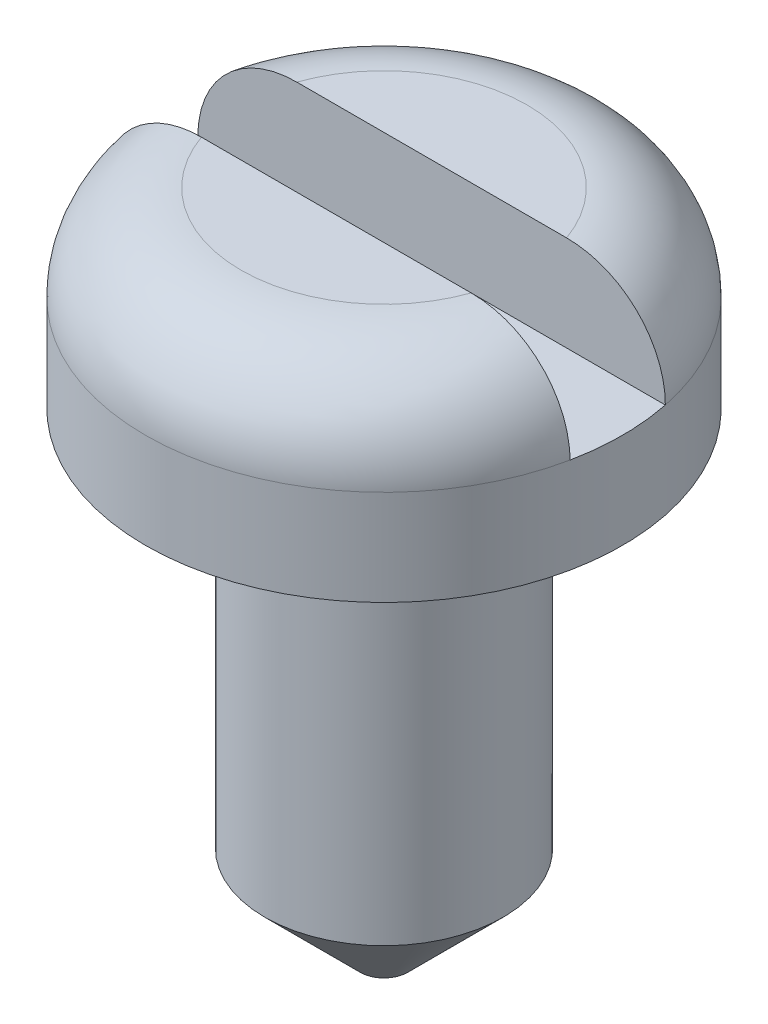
from build123d import *

# Parameters (mm, degrees)
SKETCH2_R               = 1.5875
BOSS_EXTRUDE1_DEPTH     = 6.35
SKETCH3_R               = 3.175
BOSS_EXTRUDE2_DEPTH     = 2.54
CUT_EXTRUDE1_DEPTH      = 6.096
CUT_EXTRUDE1_DEPTH_BACK = 4.318
SKETCH4_W               = 1.27
SKETCH4_H               = 2.54
FILLET2_R               = 1.27
CHAMFER1_SIZE           = 1.27


with BuildPart() as part:
    # Sketch2 → Boss-Extrude1 (new body)
    with BuildSketch(Plane(origin=(0, 0, 0), x_dir=(1, 0, 0), z_dir=(0, 1, 0))):
        with Locations(Location((0, 0, 0), (0, 0, 270))):
            Circle(SKETCH2_R)
    extrude(amount=BOSS_EXTRUDE1_DEPTH)

    # Sketch3 → Boss-Extrude2 (add)
    with BuildSketch(Plane(origin=(0, 6.35, 0), x_dir=(1, 0, 0), z_dir=(0, 1, 0))):
        with Locations(Location((0, 0, 0), (0, 0, 270))):
            Circle(SKETCH3_R)
    extrude(amount=BOSS_EXTRUDE2_DEPTH)

    # Sketch4 → Cut-Extrude1 (cut, two sides: drawn at the far end of the back side and taken through both)
    with BuildSketch(Plane(origin=(0, 0, 0), x_dir=(0, 0, -1), z_dir=(1, 0, 0)).offset(-CUT_EXTRUDE1_DEPTH_BACK)):
        with Locations((0, 8.89)):
            Rectangle(SKETCH4_W, SKETCH4_H)
    extrude(amount=CUT_EXTRUDE1_DEPTH + CUT_EXTRUDE1_DEPTH_BACK, mode=Mode.SUBTRACT)

    # Fillet2
    fillet2_edges = [part.edges().sort_by_distance(p)[0] for p in [
        (0, 8.89, -3.175),
        (-2.008046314, 8.89, 2.459344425),
    ]]
    fillet(fillet2_edges, radius=FILLET2_R)

    # Chamfer1
    chamfer1_edges = [part.edges().sort_by_distance(p)[0] for p in [
        (0, 0, -1.5875),
    ]]
    chamfer(chamfer1_edges, length=CHAMFER1_SIZE)


solid = part.part
